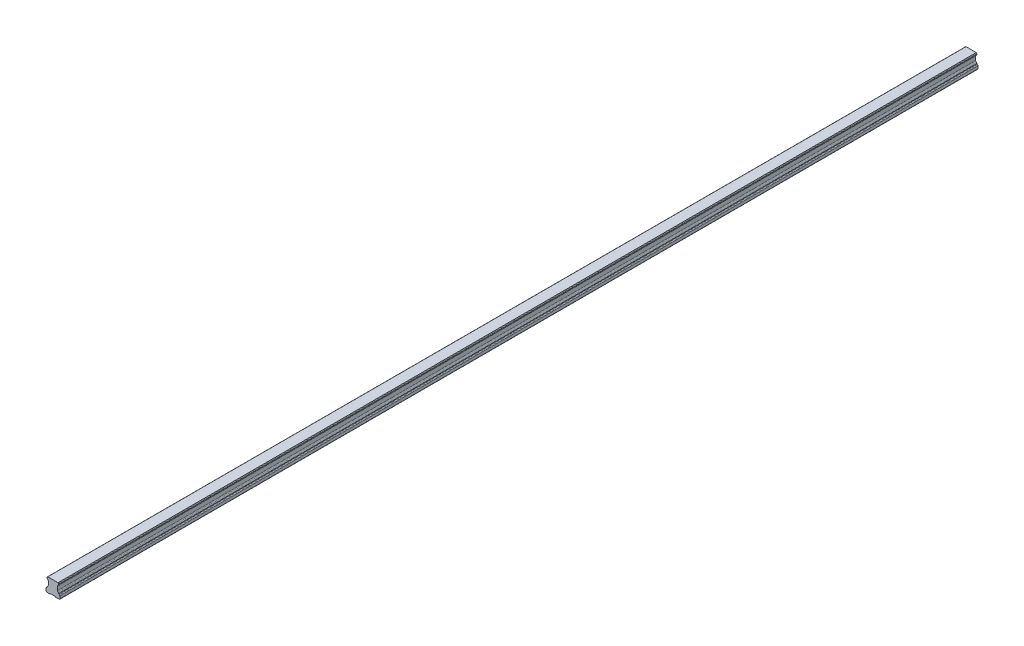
from build123d import *

# Parameters (mm, degrees)
BOSS_EXTRUDE1_DEPTH = 1000
CUT_EXTRUDE1_DEPTH  = 1001.096565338


with BuildPart() as part:
    # Sketch2 → Boss-Extrude1 (new body)
    with BuildSketch(Plane.XY):
        with BuildLine():
            Line((5.576794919, 11.7), (-5.576794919, 11.7))
            Line((-5.576794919, 11.7), (-5.75, 11.6))
            ThreePointArc((-5.75, 11.6), (-6.116025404, 11.233974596), (-6.25, 10.733974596))
            Line((-6.25, 10.733974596), (-6.25, 10.233974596))
            ThreePointArc((-6.25, 10.233974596), (-6.099836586, 9.70692832), (-5.694444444, 9.33816818))
            ThreePointArc((-5.694444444, 9.33816818), (-5.187704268, 8.877218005), (-5, 8.218410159))
            Line((-5, 8.218410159), (-5, 4.020233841))
            ThreePointArc((-5, 4.020233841), (-5.167468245, 3.395233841), (-5.625, 2.937702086))
            ThreePointArc((-5.625, 2.937702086), (-6.082531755, 2.480170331), (-6.25, 1.855170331))
            Line((-6.25, 1.855170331), (-6.25, 1.355170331))
            Line((-6.25, 1.355170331), (-6.842020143, 1.139692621))
            ThreePointArc((-6.842020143, 1.139692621), (-7.319152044, 0.773576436), (-7.5, 0.2))
            Line((-7.5, 0.2), (-7.5, 0))
            Line((-7.5, 0), (-7.5, -2.642020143))
            ThreePointArc((-7.5, -2.642020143), (-7.307282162, -3.107282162), (-6.842020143, -3.3))
            Line((-6.842020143, -3.3), (-3, -3.3))
            Line((-3, -3.3), (3, -3.3))
            Line((3, -3.3), (6.842020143, -3.3))
            ThreePointArc((6.842020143, -3.3), (7.307282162, -3.107282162), (7.5, -2.642020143))
            Line((7.5, -2.642020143), (7.5, 0))
            Line((7.5, 0), (7.5, 0.2))
            ThreePointArc((7.5, 0.2), (7.319152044, 0.773576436), (6.842020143, 1.139692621))
            Line((6.842020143, 1.139692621), (6.25, 1.355170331))
            Line((6.25, 1.355170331), (6.25, 1.855170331))
            ThreePointArc((6.25, 1.855170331), (6.082531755, 2.480170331), (5.625, 2.937702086))
            ThreePointArc((5.625, 2.937702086), (5.167468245, 3.395233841), (5, 4.020233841))
            Line((5, 4.020233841), (5, 8.218410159))
            ThreePointArc((5, 8.218410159), (5.187704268, 8.877218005), (5.694444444, 9.33816818))
            ThreePointArc((5.694444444, 9.33816818), (6.099836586, 9.70692832), (6.25, 10.233974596))
            Line((6.25, 10.233974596), (6.25, 10.733974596))
            ThreePointArc((6.25, 10.733974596), (6.116025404, 11.233974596), (5.75, 11.6))
            Line((5.75, 11.6), (5.576794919, 11.7))
        make_face()
    extrude(amount=-BOSS_EXTRUDE1_DEPTH)

    # Sketch3 → Cut-Extrude1 (cut, through all)
    with BuildSketch(Plane.XY):
        Polygon((-2.5, -2.8), (2.5, -2.8), (3, -3.3), (-3, -3.3), align=None)
    extrude(amount=-CUT_EXTRUDE1_DEPTH, mode=Mode.SUBTRACT)


solid = part.part
